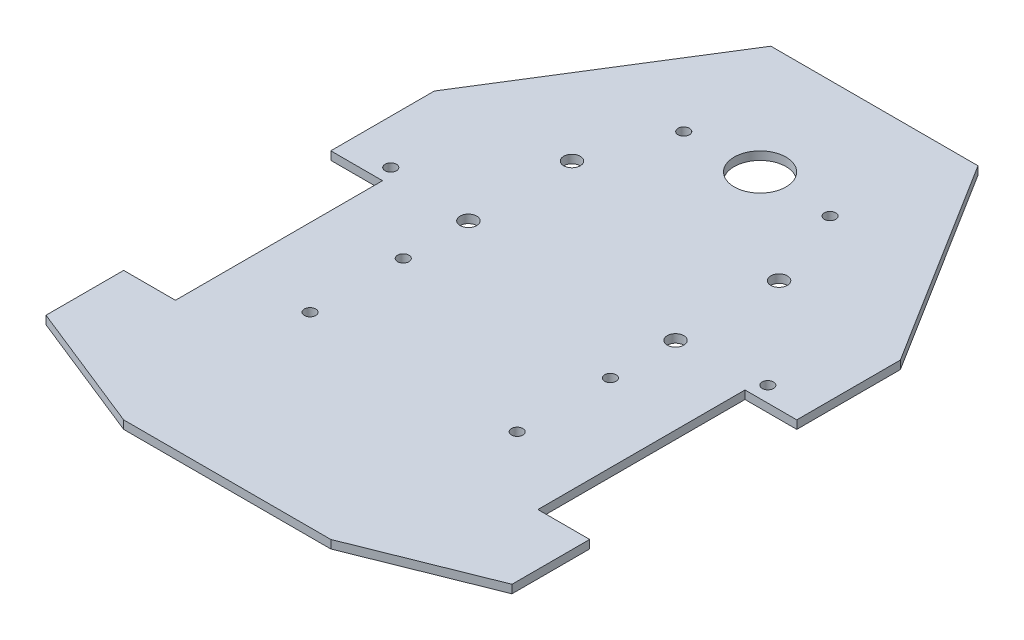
ISO-10303-21;
HEADER;
FILE_DESCRIPTION(('STEP AP214'),'2;1');
FILE_NAME('part.step','',(''),(''),'','','');
FILE_SCHEMA(('AUTOMOTIVE_DESIGN { 1 0 10303 214 1 1 1 1 }'));
ENDSEC;
DATA;
#1=APPLICATION_CONTEXT('core data for automotive mechanical design processes');
#2=APPLICATION_PROTOCOL_DEFINITION('international standard','automotive_design',2000,#1);
#3=PRODUCT_CONTEXT('',#1,'mechanical');
#4=PRODUCT('Part','Part','',(#3));
#5=PRODUCT_RELATED_PRODUCT_CATEGORY('part','',(#4));
#6=PRODUCT_DEFINITION_FORMATION('','',#4);
#7=PRODUCT_DEFINITION_CONTEXT('part definition',#1,'design');
#8=PRODUCT_DEFINITION('design','',#6,#7);
#9=PRODUCT_DEFINITION_SHAPE('','',#8);
#10=(LENGTH_UNIT() NAMED_UNIT(*) SI_UNIT(.MILLI.,.METRE.));
#11=(NAMED_UNIT(*) PLANE_ANGLE_UNIT() SI_UNIT($,.RADIAN.));
#12=(NAMED_UNIT(*) SI_UNIT($,.STERADIAN.) SOLID_ANGLE_UNIT());
#13=UNCERTAINTY_MEASURE_WITH_UNIT(LENGTH_MEASURE(1.E-05),#10,'distance_accuracy_value','');
#14=(GEOMETRIC_REPRESENTATION_CONTEXT(3) GLOBAL_UNCERTAINTY_ASSIGNED_CONTEXT((#13)) GLOBAL_UNIT_ASSIGNED_CONTEXT((#10,
#11,#12)) REPRESENTATION_CONTEXT('',''));
#15=CARTESIAN_POINT('',(0.,0.,0.));
#16=DIRECTION('',(0.,0.,1.));
#17=DIRECTION('',(1.,0.,0.));
#18=AXIS2_PLACEMENT_3D('',#15,#16,#17);
#19=CARTESIAN_POINT('',(0.,1.6,0.));
#20=DIRECTION('',(0.,1.,0.));
#21=DIRECTION('',(0.,0.,1.));
#22=AXIS2_PLACEMENT_3D('',#19,#20,#21);
#23=PLANE('',#22);
#24=CARTESIAN_POINT('',(-36.4122831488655,1.6,-8.00000000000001));
#25=DIRECTION('',(0.,1.,0.));
#26=DIRECTION('',(0.,0.,1.));
#27=AXIS2_PLACEMENT_3D('',#24,#25,#26);
#28=CIRCLE('',#27,1.1);
#29=CARTESIAN_POINT('',(-36.4122831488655,1.6,-6.90000000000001));
#30=VERTEX_POINT('',#29);
#31=EDGE_CURVE('E386',#30,#30,#28,.T.);
#32=ORIENTED_EDGE('',*,*,#31,.F.);
#33=EDGE_LOOP('',(#32));
#34=FACE_BOUND('',#33,.T.);
#35=CARTESIAN_POINT('',(14.1349171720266,1.6,-42.3019535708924));
#36=DIRECTION('',(0.,1.,0.));
#37=DIRECTION('',(0.,0.,-1.));
#38=AXIS2_PLACEMENT_3D('',#35,#36,#37);
#39=CIRCLE('',#38,1.1);
#40=CARTESIAN_POINT('',(14.1349171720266,1.6,-43.4019535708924));
#41=VERTEX_POINT('',#40);
#42=EDGE_CURVE('E401',#41,#41,#39,.T.);
#43=ORIENTED_EDGE('',*,*,#42,.F.);
#44=EDGE_LOOP('',(#43));
#45=FACE_BOUND('',#44,.T.);
#46=CARTESIAN_POINT('',(-14.1349171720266,1.6,-42.3019535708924));
#47=DIRECTION('',(0.,1.,0.));
#48=DIRECTION('',(0.,0.,1.));
#49=AXIS2_PLACEMENT_3D('',#46,#47,#48);
#50=CIRCLE('',#49,1.1);
#51=CARTESIAN_POINT('',(-14.1349171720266,1.6,-41.2019535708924));
#52=VERTEX_POINT('',#51);
#53=EDGE_CURVE('E408',#52,#52,#50,.T.);
#54=ORIENTED_EDGE('',*,*,#53,.F.);
#55=EDGE_LOOP('',(#54));
#56=FACE_BOUND('',#55,.T.);
#57=CARTESIAN_POINT('',(36.4122831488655,1.6,-8.00000000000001));
#58=DIRECTION('',(0.,1.,0.));
#59=DIRECTION('',(0.,0.,-1.));
#60=AXIS2_PLACEMENT_3D('',#57,#58,#59);
#61=CIRCLE('',#60,1.1);
#62=CARTESIAN_POINT('',(36.4122831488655,1.6,-9.1));
#63=VERTEX_POINT('',#62);
#64=EDGE_CURVE('E395',#63,#63,#61,.T.);
#65=ORIENTED_EDGE('',*,*,#64,.F.);
#66=EDGE_LOOP('',(#65));
#67=FACE_BOUND('',#66,.T.);
#68=CARTESIAN_POINT('',(-20.,1.6,-6.58187119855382));
#69=DIRECTION('',(0.,1.,0.));
#70=DIRECTION('',(0.,0.,-1.));
#71=AXIS2_PLACEMENT_3D('',#68,#69,#70);
#72=CIRCLE('',#71,1.6);
#73=CARTESIAN_POINT('',(-20.,1.6,-8.18187119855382));
#74=VERTEX_POINT('',#73);
#75=EDGE_CURVE('E393',#74,#74,#72,.T.);
#76=ORIENTED_EDGE('',*,*,#75,.F.);
#77=EDGE_LOOP('',(#76));
#78=FACE_BOUND('',#77,.T.);
#79=CARTESIAN_POINT('',(20.,1.6,-6.58187119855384));
#80=DIRECTION('',(0.,1.,0.));
#81=DIRECTION('',(0.,0.,1.));
#82=AXIS2_PLACEMENT_3D('',#79,#80,#81);
#83=CIRCLE('',#82,1.6);
#84=CARTESIAN_POINT('',(20.,1.6,-4.98187119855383));
#85=VERTEX_POINT('',#84);
#86=EDGE_CURVE('E419',#85,#85,#83,.T.);
#87=ORIENTED_EDGE('',*,*,#86,.F.);
#88=EDGE_LOOP('',(#87));
#89=FACE_BOUND('',#88,.T.);
#90=CARTESIAN_POINT('',(20.,1.6,-26.5818711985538));
#91=DIRECTION('',(0.,1.,0.));
#92=DIRECTION('',(0.,0.,-1.));
#93=AXIS2_PLACEMENT_3D('',#90,#91,#92);
#94=CIRCLE('',#93,1.6);
#95=CARTESIAN_POINT('',(20.,1.6,-28.1818711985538));
#96=VERTEX_POINT('',#95);
#97=EDGE_CURVE('E418',#96,#96,#94,.T.);
#98=ORIENTED_EDGE('',*,*,#97,.F.);
#99=EDGE_LOOP('',(#98));
#100=FACE_BOUND('',#99,.T.);
#101=CARTESIAN_POINT('',(-20.,1.6,-26.5818711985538));
#102=DIRECTION('',(0.,1.,0.));
#103=DIRECTION('',(0.,0.,1.));
#104=AXIS2_PLACEMENT_3D('',#101,#102,#103);
#105=CIRCLE('',#104,1.6);
#106=CARTESIAN_POINT('',(-20.,1.6,-24.9818711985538));
#107=VERTEX_POINT('',#106);
#108=EDGE_CURVE('E422',#107,#107,#105,.T.);
#109=ORIENTED_EDGE('',*,*,#108,.F.);
#110=EDGE_LOOP('',(#109));
#111=FACE_BOUND('',#110,.T.);
#112=CARTESIAN_POINT('',(20.,1.6,6.00000000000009));
#113=DIRECTION('',(0.,1.,0.));
#114=DIRECTION('',(0.,0.,-1.));
#115=AXIS2_PLACEMENT_3D('',#112,#113,#114);
#116=CIRCLE('',#115,1.1);
#117=CARTESIAN_POINT('',(20.,1.6,4.90000000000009));
#118=VERTEX_POINT('',#117);
#119=EDGE_CURVE('E449',#118,#118,#116,.T.);
#120=ORIENTED_EDGE('',*,*,#119,.F.);
#121=EDGE_LOOP('',(#120));
#122=FACE_BOUND('',#121,.T.);
#123=CARTESIAN_POINT('',(20.,1.6,24.0000000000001));
#124=DIRECTION('',(0.,1.,0.));
#125=DIRECTION('',(0.,0.,1.));
#126=AXIS2_PLACEMENT_3D('',#123,#124,#125);
#127=CIRCLE('',#126,1.1);
#128=CARTESIAN_POINT('',(20.,1.6,25.1000000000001));
#129=VERTEX_POINT('',#128);
#130=EDGE_CURVE('E443',#129,#129,#127,.T.);
#131=ORIENTED_EDGE('',*,*,#130,.F.);
#132=EDGE_LOOP('',(#131));
#133=FACE_BOUND('',#132,.T.);
#134=CARTESIAN_POINT('',(-20.,1.6,24.0000000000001));
#135=DIRECTION('',(0.,1.,0.));
#136=DIRECTION('',(0.,0.,-1.));
#137=AXIS2_PLACEMENT_3D('',#134,#135,#136);
#138=CIRCLE('',#137,1.1);
#139=CARTESIAN_POINT('',(-20.,1.6,22.9000000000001));
#140=VERTEX_POINT('',#139);
#141=EDGE_CURVE('E436',#140,#140,#138,.T.);
#142=ORIENTED_EDGE('',*,*,#141,.F.);
#143=EDGE_LOOP('',(#142));
#144=FACE_BOUND('',#143,.T.);
#145=CARTESIAN_POINT('',(-20.,1.6,6.00000000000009));
#146=DIRECTION('',(0.,1.,0.));
#147=DIRECTION('',(0.,0.,1.));
#148=AXIS2_PLACEMENT_3D('',#145,#146,#147);
#149=CIRCLE('',#148,1.1);
#150=CARTESIAN_POINT('',(-20.,1.6,7.10000000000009));
#151=VERTEX_POINT('',#150);
#152=EDGE_CURVE('E439',#151,#151,#149,.T.);
#153=ORIENTED_EDGE('',*,*,#152,.F.);
#154=EDGE_LOOP('',(#153));
#155=FACE_BOUND('',#154,.T.);
#156=DIRECTION('',(-0.529998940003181,0.,0.847998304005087));
#157=VECTOR('',#156,1.);
#158=CARTESIAN_POINT('',(-45.0000000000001,1.6,-24.9999999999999));
#159=LINE('',#158,#157);
#160=CARTESIAN_POINT('',(-20.,1.6,-64.9999999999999));
#161=VERTEX_POINT('',#160);
#162=CARTESIAN_POINT('',(-45.0000000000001,1.6,-24.9999999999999));
#163=VERTEX_POINT('',#162);
#164=EDGE_CURVE('E224',#161,#163,#159,.T.);
#165=ORIENTED_EDGE('',*,*,#164,.T.);
#166=DIRECTION('',(0.,0.,1.));
#167=VECTOR('',#166,1.);
#168=CARTESIAN_POINT('',(-45.0000000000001,1.6,-24.9999999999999));
#169=LINE('',#168,#167);
#170=CARTESIAN_POINT('',(-45.,1.6,-5.));
#171=VERTEX_POINT('',#170);
#172=EDGE_CURVE('E132',#163,#171,#169,.T.);
#173=ORIENTED_EDGE('',*,*,#172,.T.);
#174=DIRECTION('',(1.,0.,0.));
#175=VECTOR('',#174,1.);
#176=CARTESIAN_POINT('',(-35.,1.6,-5.));
#177=LINE('',#176,#175);
#178=CARTESIAN_POINT('',(-35.,1.6,-5.));
#179=VERTEX_POINT('',#178);
#180=EDGE_CURVE('E263',#171,#179,#177,.T.);
#181=ORIENTED_EDGE('',*,*,#180,.T.);
#182=DIRECTION('',(0.,0.,1.));
#183=VECTOR('',#182,1.);
#184=CARTESIAN_POINT('',(-35.,1.6,35.));
#185=LINE('',#184,#183);
#186=CARTESIAN_POINT('',(-35.,1.6,35.));
#187=VERTEX_POINT('',#186);
#188=EDGE_CURVE('E282',#179,#187,#185,.T.);
#189=ORIENTED_EDGE('',*,*,#188,.T.);
#190=DIRECTION('',(-1.,0.,0.));
#191=VECTOR('',#190,1.);
#192=CARTESIAN_POINT('',(-45.,1.6,35.));
#193=LINE('',#192,#191);
#194=CARTESIAN_POINT('',(-45.,1.6,35.));
#195=VERTEX_POINT('',#194);
#196=EDGE_CURVE('E279',#187,#195,#193,.T.);
#197=ORIENTED_EDGE('',*,*,#196,.T.);
#198=DIRECTION('',(0.,0.,1.));
#199=VECTOR('',#198,1.);
#200=CARTESIAN_POINT('',(-45.,1.6,35.));
#201=LINE('',#200,#199);
#202=CARTESIAN_POINT('',(-45.,1.6,50.));
#203=VERTEX_POINT('',#202);
#204=EDGE_CURVE('E281',#195,#203,#201,.T.);
#205=ORIENTED_EDGE('',*,*,#204,.T.);
#206=DIRECTION('',(0.928476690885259,0.,0.371390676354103));
#207=VECTOR('',#206,1.);
#208=CARTESIAN_POINT('',(-20.,1.6,60.));
#209=LINE('',#208,#207);
#210=CARTESIAN_POINT('',(-20.,1.6,60.));
#211=VERTEX_POINT('',#210);
#212=EDGE_CURVE('E284',#203,#211,#209,.T.);
#213=ORIENTED_EDGE('',*,*,#212,.T.);
#214=DIRECTION('',(1.,0.,0.));
#215=VECTOR('',#214,1.);
#216=CARTESIAN_POINT('',(-20.,1.6,60.));
#217=LINE('',#216,#215);
#218=CARTESIAN_POINT('',(20.,1.6,60.));
#219=VERTEX_POINT('',#218);
#220=EDGE_CURVE('E290',#211,#219,#217,.T.);
#221=ORIENTED_EDGE('',*,*,#220,.T.);
#222=DIRECTION('',(0.928476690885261,0.,-0.3713906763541));
#223=VECTOR('',#222,1.);
#224=CARTESIAN_POINT('',(20.,1.6,60.));
#225=LINE('',#224,#223);
#226=CARTESIAN_POINT('',(45.0000000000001,1.6,50.0000000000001));
#227=VERTEX_POINT('',#226);
#228=EDGE_CURVE('E292',#219,#227,#225,.T.);
#229=ORIENTED_EDGE('',*,*,#228,.T.);
#230=DIRECTION('',(0.,0.,-1.));
#231=VECTOR('',#230,1.);
#232=CARTESIAN_POINT('',(45.0000000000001,1.6,35.0000000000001));
#233=LINE('',#232,#231);
#234=CARTESIAN_POINT('',(45.0000000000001,1.6,35.0000000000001));
#235=VERTEX_POINT('',#234);
#236=EDGE_CURVE('E294',#227,#235,#233,.T.);
#237=ORIENTED_EDGE('',*,*,#236,.T.);
#238=DIRECTION('',(-1.,0.,0.));
#239=VECTOR('',#238,1.);
#240=CARTESIAN_POINT('',(45.0000000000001,1.6,35.0000000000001));
#241=LINE('',#240,#239);
#242=CARTESIAN_POINT('',(35.0000000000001,1.6,35.0000000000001));
#243=VERTEX_POINT('',#242);
#244=EDGE_CURVE('E296',#235,#243,#241,.T.);
#245=ORIENTED_EDGE('',*,*,#244,.T.);
#246=DIRECTION('',(0.,0.,-1.));
#247=VECTOR('',#246,1.);
#248=CARTESIAN_POINT('',(35.0000000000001,1.6,35.0000000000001));
#249=LINE('',#248,#247);
#250=CARTESIAN_POINT('',(35.,1.6,-4.99999999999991));
#251=VERTEX_POINT('',#250);
#252=EDGE_CURVE('E298',#243,#251,#249,.T.);
#253=ORIENTED_EDGE('',*,*,#252,.T.);
#254=DIRECTION('',(1.,0.,0.));
#255=VECTOR('',#254,1.);
#256=CARTESIAN_POINT('',(35.,1.6,-4.99999999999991));
#257=LINE('',#256,#255);
#258=CARTESIAN_POINT('',(45.,1.6,-5.));
#259=VERTEX_POINT('',#258);
#260=EDGE_CURVE('E175',#251,#259,#257,.T.);
#261=ORIENTED_EDGE('',*,*,#260,.T.);
#262=DIRECTION('',(0.,0.,-1.));
#263=VECTOR('',#262,1.);
#264=CARTESIAN_POINT('',(45.0000000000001,1.6,-24.9999999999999));
#265=LINE('',#264,#263);
#266=CARTESIAN_POINT('',(45.0000000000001,1.6,-24.9999999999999));
#267=VERTEX_POINT('',#266);
#268=EDGE_CURVE('E169',#259,#267,#265,.T.);
#269=ORIENTED_EDGE('',*,*,#268,.T.);
#270=DIRECTION('',(-0.529998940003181,0.,-0.847998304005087));
#271=VECTOR('',#270,1.);
#272=CARTESIAN_POINT('',(45.0000000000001,1.6,-24.9999999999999));
#273=LINE('',#272,#271);
#274=CARTESIAN_POINT('',(20.,1.6,-64.9999999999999));
#275=VERTEX_POINT('',#274);
#276=EDGE_CURVE('E173',#267,#275,#273,.T.);
#277=ORIENTED_EDGE('',*,*,#276,.T.);
#278=DIRECTION('',(-1.,0.,0.));
#279=VECTOR('',#278,1.);
#280=CARTESIAN_POINT('',(-20.,1.6,-64.9999999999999));
#281=LINE('',#280,#279);
#282=EDGE_CURVE('E65',#275,#161,#281,.T.);
#283=ORIENTED_EDGE('',*,*,#282,.T.);
#284=EDGE_LOOP('',(#165,#173,#181,#189,#197,#205,#213,#221,#229,#237,#245,#253,#261,#269,#277,#283));
#285=FACE_BOUND('',#284,.T.);
#286=CARTESIAN_POINT('',(0.,1.6,-42.9149479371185));
#287=DIRECTION('',(0.,1.,0.));
#288=DIRECTION('',(0.,0.,1.));
#289=AXIS2_PLACEMENT_3D('',#286,#287,#288);
#290=CIRCLE('',#289,5.);
#291=CARTESIAN_POINT('',(0.,1.6,-37.9149479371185));
#292=VERTEX_POINT('',#291);
#293=EDGE_CURVE('E197',#292,#292,#290,.T.);
#294=ORIENTED_EDGE('',*,*,#293,.F.);
#295=EDGE_LOOP('',(#294));
#296=FACE_BOUND('',#295,.T.);
#297=ADVANCED_FACE('F48',(#34,#45,#56,#67,#78,#89,#100,#111,#122,#133,#144,#155,#285,#296),#23,.T.);
#298=CARTESIAN_POINT('',(0.,0.,0.));
#299=DIRECTION('',(0.,1.,0.));
#300=DIRECTION('',(0.,0.,1.));
#301=AXIS2_PLACEMENT_3D('',#298,#299,#300);
#302=PLANE('',#301);
#303=CARTESIAN_POINT('',(-36.4122831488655,0.,-8.00000000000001));
#304=DIRECTION('',(0.,1.,0.));
#305=DIRECTION('',(0.,0.,1.));
#306=AXIS2_PLACEMENT_3D('',#303,#304,#305);
#307=CIRCLE('',#306,1.1);
#308=CARTESIAN_POINT('',(-36.4122831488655,0.,-6.90000000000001));
#309=VERTEX_POINT('',#308);
#310=EDGE_CURVE('E389',#309,#309,#307,.F.);
#311=ORIENTED_EDGE('',*,*,#310,.F.);
#312=EDGE_LOOP('',(#311));
#313=FACE_BOUND('',#312,.T.);
#314=CARTESIAN_POINT('',(14.1349171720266,0.,-42.3019535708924));
#315=DIRECTION('',(0.,1.,0.));
#316=DIRECTION('',(0.,0.,1.));
#317=AXIS2_PLACEMENT_3D('',#314,#315,#316);
#318=CIRCLE('',#317,1.1);
#319=CARTESIAN_POINT('',(14.1349171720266,0.,-41.2019535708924));
#320=VERTEX_POINT('',#319);
#321=EDGE_CURVE('E398',#320,#320,#318,.F.);
#322=ORIENTED_EDGE('',*,*,#321,.F.);
#323=EDGE_LOOP('',(#322));
#324=FACE_BOUND('',#323,.T.);
#325=CARTESIAN_POINT('',(-14.1349171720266,0.,-42.3019535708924));
#326=DIRECTION('',(0.,1.,0.));
#327=DIRECTION('',(0.,0.,1.));
#328=AXIS2_PLACEMENT_3D('',#325,#326,#327);
#329=CIRCLE('',#328,1.1);
#330=CARTESIAN_POINT('',(-14.1349171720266,0.,-41.2019535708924));
#331=VERTEX_POINT('',#330);
#332=EDGE_CURVE('E404',#331,#331,#329,.F.);
#333=ORIENTED_EDGE('',*,*,#332,.F.);
#334=EDGE_LOOP('',(#333));
#335=FACE_BOUND('',#334,.T.);
#336=CARTESIAN_POINT('',(36.4122831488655,0.,-8.00000000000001));
#337=DIRECTION('',(0.,1.,0.));
#338=DIRECTION('',(0.,0.,1.));
#339=AXIS2_PLACEMENT_3D('',#336,#337,#338);
#340=CIRCLE('',#339,1.1);
#341=CARTESIAN_POINT('',(36.4122831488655,0.,-6.90000000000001));
#342=VERTEX_POINT('',#341);
#343=EDGE_CURVE('E405',#342,#342,#340,.F.);
#344=ORIENTED_EDGE('',*,*,#343,.F.);
#345=EDGE_LOOP('',(#344));
#346=FACE_BOUND('',#345,.T.);
#347=CARTESIAN_POINT('',(-20.,0.,-6.58187119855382));
#348=DIRECTION('',(0.,1.,0.));
#349=DIRECTION('',(0.,0.,1.));
#350=AXIS2_PLACEMENT_3D('',#347,#348,#349);
#351=CIRCLE('',#350,1.6);
#352=CARTESIAN_POINT('',(-20.,0.,-4.98187119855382));
#353=VERTEX_POINT('',#352);
#354=EDGE_CURVE('E390',#353,#353,#351,.F.);
#355=ORIENTED_EDGE('',*,*,#354,.F.);
#356=EDGE_LOOP('',(#355));
#357=FACE_BOUND('',#356,.T.);
#358=CARTESIAN_POINT('',(20.,0.,-6.58187119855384));
#359=DIRECTION('',(0.,1.,0.));
#360=DIRECTION('',(0.,0.,1.));
#361=AXIS2_PLACEMENT_3D('',#358,#359,#360);
#362=CIRCLE('',#361,1.6);
#363=CARTESIAN_POINT('',(20.,0.,-4.98187119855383));
#364=VERTEX_POINT('',#363);
#365=EDGE_CURVE('E423',#364,#364,#362,.F.);
#366=ORIENTED_EDGE('',*,*,#365,.F.);
#367=EDGE_LOOP('',(#366));
#368=FACE_BOUND('',#367,.T.);
#369=CARTESIAN_POINT('',(20.,0.,-26.5818711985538));
#370=DIRECTION('',(0.,1.,0.));
#371=DIRECTION('',(0.,0.,1.));
#372=AXIS2_PLACEMENT_3D('',#369,#370,#371);
#373=CIRCLE('',#372,1.6);
#374=CARTESIAN_POINT('',(20.,0.,-24.9818711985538));
#375=VERTEX_POINT('',#374);
#376=EDGE_CURVE('E415',#375,#375,#373,.F.);
#377=ORIENTED_EDGE('',*,*,#376,.F.);
#378=EDGE_LOOP('',(#377));
#379=FACE_BOUND('',#378,.T.);
#380=CARTESIAN_POINT('',(-20.,0.,-26.5818711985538));
#381=DIRECTION('',(0.,1.,0.));
#382=DIRECTION('',(0.,0.,1.));
#383=AXIS2_PLACEMENT_3D('',#380,#381,#382);
#384=CIRCLE('',#383,1.6);
#385=CARTESIAN_POINT('',(-20.,0.,-24.9818711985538));
#386=VERTEX_POINT('',#385);
#387=EDGE_CURVE('E432',#386,#386,#384,.F.);
#388=ORIENTED_EDGE('',*,*,#387,.F.);
#389=EDGE_LOOP('',(#388));
#390=FACE_BOUND('',#389,.T.);
#391=CARTESIAN_POINT('',(20.,0.,6.00000000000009));
#392=DIRECTION('',(0.,1.,0.));
#393=DIRECTION('',(0.,0.,-1.));
#394=AXIS2_PLACEMENT_3D('',#391,#392,#393);
#395=CIRCLE('',#394,1.1);
#396=CARTESIAN_POINT('',(20.,0.,4.90000000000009));
#397=VERTEX_POINT('',#396);
#398=EDGE_CURVE('E435',#397,#397,#395,.T.);
#399=ORIENTED_EDGE('',*,*,#398,.T.);
#400=EDGE_LOOP('',(#399));
#401=FACE_BOUND('',#400,.T.);
#402=CARTESIAN_POINT('',(20.,0.,24.0000000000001));
#403=DIRECTION('',(0.,1.,0.));
#404=DIRECTION('',(0.,0.,1.));
#405=AXIS2_PLACEMENT_3D('',#402,#403,#404);
#406=CIRCLE('',#405,1.1);
#407=CARTESIAN_POINT('',(20.,0.,25.1000000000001));
#408=VERTEX_POINT('',#407);
#409=EDGE_CURVE('E446',#408,#408,#406,.T.);
#410=ORIENTED_EDGE('',*,*,#409,.T.);
#411=EDGE_LOOP('',(#410));
#412=FACE_BOUND('',#411,.T.);
#413=CARTESIAN_POINT('',(-20.,0.,24.0000000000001));
#414=DIRECTION('',(0.,1.,0.));
#415=DIRECTION('',(0.,0.,-1.));
#416=AXIS2_PLACEMENT_3D('',#413,#414,#415);
#417=CIRCLE('',#416,1.1);
#418=CARTESIAN_POINT('',(-20.,0.,22.9000000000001));
#419=VERTEX_POINT('',#418);
#420=EDGE_CURVE('E440',#419,#419,#417,.T.);
#421=ORIENTED_EDGE('',*,*,#420,.T.);
#422=EDGE_LOOP('',(#421));
#423=FACE_BOUND('',#422,.T.);
#424=CARTESIAN_POINT('',(-20.,0.,6.00000000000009));
#425=DIRECTION('',(0.,1.,0.));
#426=DIRECTION('',(0.,0.,1.));
#427=AXIS2_PLACEMENT_3D('',#424,#425,#426);
#428=CIRCLE('',#427,1.1);
#429=CARTESIAN_POINT('',(-20.,0.,7.10000000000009));
#430=VERTEX_POINT('',#429);
#431=EDGE_CURVE('E454',#430,#430,#428,.T.);
#432=ORIENTED_EDGE('',*,*,#431,.T.);
#433=EDGE_LOOP('',(#432));
#434=FACE_BOUND('',#433,.T.);
#435=DIRECTION('',(-0.529998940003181,0.,0.847998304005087));
#436=VECTOR('',#435,1.);
#437=CARTESIAN_POINT('',(-45.0000000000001,0.,-24.9999999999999));
#438=LINE('',#437,#436);
#439=CARTESIAN_POINT('',(-20.,0.,-64.9999999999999));
#440=VERTEX_POINT('',#439);
#441=CARTESIAN_POINT('',(-45.0000000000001,0.,-24.9999999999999));
#442=VERTEX_POINT('',#441);
#443=EDGE_CURVE('E193',#440,#442,#438,.T.);
#444=ORIENTED_EDGE('',*,*,#443,.F.);
#445=DIRECTION('',(-1.,0.,0.));
#446=VECTOR('',#445,1.);
#447=CARTESIAN_POINT('',(-20.,0.,-64.9999999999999));
#448=LINE('',#447,#446);
#449=CARTESIAN_POINT('',(20.,0.,-64.9999999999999));
#450=VERTEX_POINT('',#449);
#451=EDGE_CURVE('E124',#450,#440,#448,.T.);
#452=ORIENTED_EDGE('',*,*,#451,.F.);
#453=DIRECTION('',(-0.529998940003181,0.,-0.847998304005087));
#454=VECTOR('',#453,1.);
#455=CARTESIAN_POINT('',(45.0000000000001,0.,-24.9999999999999));
#456=LINE('',#455,#454);
#457=CARTESIAN_POINT('',(45.0000000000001,0.,-24.9999999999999));
#458=VERTEX_POINT('',#457);
#459=EDGE_CURVE('E118',#458,#450,#456,.T.);
#460=ORIENTED_EDGE('',*,*,#459,.F.);
#461=DIRECTION('',(0.,0.,-1.));
#462=VECTOR('',#461,1.);
#463=CARTESIAN_POINT('',(45.0000000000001,0.,-24.9999999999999));
#464=LINE('',#463,#462);
#465=CARTESIAN_POINT('',(45.,0.,-5.));
#466=VERTEX_POINT('',#465);
#467=EDGE_CURVE('E183',#466,#458,#464,.T.);
#468=ORIENTED_EDGE('',*,*,#467,.F.);
#469=DIRECTION('',(1.,0.,0.));
#470=VECTOR('',#469,1.);
#471=CARTESIAN_POINT('',(35.,0.,-4.99999999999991));
#472=LINE('',#471,#470);
#473=CARTESIAN_POINT('',(35.,0.,-4.99999999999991));
#474=VERTEX_POINT('',#473);
#475=EDGE_CURVE('E219',#474,#466,#472,.T.);
#476=ORIENTED_EDGE('',*,*,#475,.F.);
#477=DIRECTION('',(0.,0.,-1.));
#478=VECTOR('',#477,1.);
#479=CARTESIAN_POINT('',(35.0000000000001,0.,35.0000000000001));
#480=LINE('',#479,#478);
#481=CARTESIAN_POINT('',(35.0000000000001,0.,35.0000000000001));
#482=VERTEX_POINT('',#481);
#483=EDGE_CURVE('E217',#482,#474,#480,.T.);
#484=ORIENTED_EDGE('',*,*,#483,.F.);
#485=DIRECTION('',(-1.,0.,0.));
#486=VECTOR('',#485,1.);
#487=CARTESIAN_POINT('',(45.0000000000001,0.,35.0000000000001));
#488=LINE('',#487,#486);
#489=CARTESIAN_POINT('',(45.0000000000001,0.,35.0000000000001));
#490=VERTEX_POINT('',#489);
#491=EDGE_CURVE('E215',#490,#482,#488,.T.);
#492=ORIENTED_EDGE('',*,*,#491,.F.);
#493=DIRECTION('',(0.,0.,-1.));
#494=VECTOR('',#493,1.);
#495=CARTESIAN_POINT('',(45.0000000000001,0.,35.0000000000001));
#496=LINE('',#495,#494);
#497=CARTESIAN_POINT('',(45.0000000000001,0.,50.0000000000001));
#498=VERTEX_POINT('',#497);
#499=EDGE_CURVE('E213',#498,#490,#496,.T.);
#500=ORIENTED_EDGE('',*,*,#499,.F.);
#501=DIRECTION('',(0.928476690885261,0.,-0.3713906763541));
#502=VECTOR('',#501,1.);
#503=CARTESIAN_POINT('',(20.,0.,60.));
#504=LINE('',#503,#502);
#505=CARTESIAN_POINT('',(20.,0.,60.));
#506=VERTEX_POINT('',#505);
#507=EDGE_CURVE('E211',#506,#498,#504,.T.);
#508=ORIENTED_EDGE('',*,*,#507,.F.);
#509=DIRECTION('',(1.,0.,0.));
#510=VECTOR('',#509,1.);
#511=CARTESIAN_POINT('',(-20.,0.,60.));
#512=LINE('',#511,#510);
#513=CARTESIAN_POINT('',(-20.,0.,60.));
#514=VERTEX_POINT('',#513);
#515=EDGE_CURVE('E209',#514,#506,#512,.T.);
#516=ORIENTED_EDGE('',*,*,#515,.F.);
#517=DIRECTION('',(0.928476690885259,0.,0.371390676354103));
#518=VECTOR('',#517,1.);
#519=CARTESIAN_POINT('',(-20.,0.,60.));
#520=LINE('',#519,#518);
#521=CARTESIAN_POINT('',(-45.,0.,50.));
#522=VERTEX_POINT('',#521);
#523=EDGE_CURVE('E207',#522,#514,#520,.T.);
#524=ORIENTED_EDGE('',*,*,#523,.F.);
#525=DIRECTION('',(0.,0.,1.));
#526=VECTOR('',#525,1.);
#527=CARTESIAN_POINT('',(-45.,0.,35.));
#528=LINE('',#527,#526);
#529=CARTESIAN_POINT('',(-45.,0.,35.));
#530=VERTEX_POINT('',#529);
#531=EDGE_CURVE('E205',#530,#522,#528,.T.);
#532=ORIENTED_EDGE('',*,*,#531,.F.);
#533=DIRECTION('',(-1.,0.,0.));
#534=VECTOR('',#533,1.);
#535=CARTESIAN_POINT('',(-45.,0.,35.));
#536=LINE('',#535,#534);
#537=CARTESIAN_POINT('',(-35.,0.,35.));
#538=VERTEX_POINT('',#537);
#539=EDGE_CURVE('E203',#538,#530,#536,.T.);
#540=ORIENTED_EDGE('',*,*,#539,.F.);
#541=DIRECTION('',(0.,0.,1.));
#542=VECTOR('',#541,1.);
#543=CARTESIAN_POINT('',(-35.,0.,35.));
#544=LINE('',#543,#542);
#545=CARTESIAN_POINT('',(-35.,0.,-5.));
#546=VERTEX_POINT('',#545);
#547=EDGE_CURVE('E201',#546,#538,#544,.T.);
#548=ORIENTED_EDGE('',*,*,#547,.F.);
#549=DIRECTION('',(1.,0.,0.));
#550=VECTOR('',#549,1.);
#551=CARTESIAN_POINT('',(-35.,0.,-5.));
#552=LINE('',#551,#550);
#553=CARTESIAN_POINT('',(-45.,0.,-5.));
#554=VERTEX_POINT('',#553);
#555=EDGE_CURVE('E199',#554,#546,#552,.T.);
#556=ORIENTED_EDGE('',*,*,#555,.F.);
#557=DIRECTION('',(0.,0.,1.));
#558=VECTOR('',#557,1.);
#559=CARTESIAN_POINT('',(-45.0000000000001,0.,-24.9999999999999));
#560=LINE('',#559,#558);
#561=EDGE_CURVE('E196',#442,#554,#560,.T.);
#562=ORIENTED_EDGE('',*,*,#561,.F.);
#563=EDGE_LOOP('',(#444,#452,#460,#468,#476,#484,#492,#500,#508,#516,#524,#532,#540,#548,#556,#562));
#564=FACE_BOUND('',#563,.T.);
#565=CARTESIAN_POINT('',(0.,0.,-42.9149479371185));
#566=DIRECTION('',(0.,1.,0.));
#567=DIRECTION('',(0.,0.,1.));
#568=AXIS2_PLACEMENT_3D('',#565,#566,#567);
#569=CIRCLE('',#568,5.);
#570=CARTESIAN_POINT('',(0.,0.,-37.9149479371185));
#571=VERTEX_POINT('',#570);
#572=EDGE_CURVE('E457',#571,#571,#569,.T.);
#573=ORIENTED_EDGE('',*,*,#572,.T.);
#574=EDGE_LOOP('',(#573));
#575=FACE_BOUND('',#574,.T.);
#576=ADVANCED_FACE('F267',(#313,#324,#335,#346,#357,#368,#379,#390,#401,#412,#423,#434,#564,
#575),#302,.F.);
#577=CARTESIAN_POINT('',(-45.0000000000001,1.6,-24.9999999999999));
#578=DIRECTION('',(0.847998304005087,0.,0.529998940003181));
#579=DIRECTION('',(0.529998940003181,0.,-0.847998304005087));
#580=AXIS2_PLACEMENT_3D('',#577,#578,#579);
#581=PLANE('',#580);
#582=ORIENTED_EDGE('',*,*,#443,.T.);
#583=DIRECTION('',(0.,-1.,0.));
#584=VECTOR('',#583,1.);
#585=CARTESIAN_POINT('',(-45.0000000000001,1.6,-24.9999999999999));
#586=LINE('',#585,#584);
#587=EDGE_CURVE('E13',#163,#442,#586,.T.);
#588=ORIENTED_EDGE('',*,*,#587,.F.);
#589=ORIENTED_EDGE('',*,*,#164,.F.);
#590=DIRECTION('',(0.,-1.,0.));
#591=VECTOR('',#590,1.);
#592=CARTESIAN_POINT('',(-20.,1.6,-64.9999999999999));
#593=LINE('',#592,#591);
#594=EDGE_CURVE('E189',#161,#440,#593,.T.);
#595=ORIENTED_EDGE('',*,*,#594,.T.);
#596=EDGE_LOOP('',(#582,#588,#589,#595));
#597=FACE_BOUND('',#596,.T.);
#598=ADVANCED_FACE('F50',(#597),#581,.F.);
#599=CARTESIAN_POINT('',(-45.0000000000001,1.6,-24.9999999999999));
#600=DIRECTION('',(1.,0.,0.));
#601=DIRECTION('',(0.,0.,-1.));
#602=AXIS2_PLACEMENT_3D('',#599,#600,#601);
#603=PLANE('',#602);
#604=ORIENTED_EDGE('',*,*,#561,.T.);
#605=DIRECTION('',(0.,-1.,0.));
#606=VECTOR('',#605,1.);
#607=CARTESIAN_POINT('',(-45.,1.6,-5.));
#608=LINE('',#607,#606);
#609=EDGE_CURVE('E57',#171,#554,#608,.T.);
#610=ORIENTED_EDGE('',*,*,#609,.F.);
#611=ORIENTED_EDGE('',*,*,#172,.F.);
#612=ORIENTED_EDGE('',*,*,#587,.T.);
#613=EDGE_LOOP('',(#604,#610,#611,#612));
#614=FACE_BOUND('',#613,.T.);
#615=ADVANCED_FACE('F702',(#614),#603,.F.);
#616=CARTESIAN_POINT('',(-35.,1.6,-5.));
#617=DIRECTION('',(0.,0.,-1.));
#618=DIRECTION('',(-1.,0.,0.));
#619=AXIS2_PLACEMENT_3D('',#616,#617,#618);
#620=PLANE('',#619);
#621=ORIENTED_EDGE('',*,*,#555,.T.);
#622=DIRECTION('',(0.,-1.,0.));
#623=VECTOR('',#622,1.);
#624=CARTESIAN_POINT('',(-35.,1.6,-5.));
#625=LINE('',#624,#623);
#626=EDGE_CURVE('E255',#179,#546,#625,.T.);
#627=ORIENTED_EDGE('',*,*,#626,.F.);
#628=ORIENTED_EDGE('',*,*,#180,.F.);
#629=ORIENTED_EDGE('',*,*,#609,.T.);
#630=EDGE_LOOP('',(#621,#627,#628,#629));
#631=FACE_BOUND('',#630,.T.);
#632=ADVANCED_FACE('F261',(#631),#620,.F.);
#633=CARTESIAN_POINT('',(-35.,1.6,35.));
#634=DIRECTION('',(1.,0.,0.));
#635=DIRECTION('',(0.,0.,-1.));
#636=AXIS2_PLACEMENT_3D('',#633,#634,#635);
#637=PLANE('',#636);
#638=ORIENTED_EDGE('',*,*,#547,.T.);
#639=DIRECTION('',(0.,-1.,0.));
#640=VECTOR('',#639,1.);
#641=CARTESIAN_POINT('',(-35.,1.6,35.));
#642=LINE('',#641,#640);
#643=EDGE_CURVE('E252',#187,#538,#642,.T.);
#644=ORIENTED_EDGE('',*,*,#643,.F.);
#645=ORIENTED_EDGE('',*,*,#188,.F.);
#646=ORIENTED_EDGE('',*,*,#626,.T.);
#647=EDGE_LOOP('',(#638,#644,#645,#646));
#648=FACE_BOUND('',#647,.T.);
#649=ADVANCED_FACE('F273',(#648),#637,.F.);
#650=CARTESIAN_POINT('',(-45.,1.6,35.));
#651=DIRECTION('',(0.,0.,1.));
#652=DIRECTION('',(1.,0.,0.));
#653=AXIS2_PLACEMENT_3D('',#650,#651,#652);
#654=PLANE('',#653);
#655=ORIENTED_EDGE('',*,*,#539,.T.);
#656=DIRECTION('',(0.,-1.,0.));
#657=VECTOR('',#656,1.);
#658=CARTESIAN_POINT('',(-45.,1.6,35.));
#659=LINE('',#658,#657);
#660=EDGE_CURVE('E249',#195,#530,#659,.T.);
#661=ORIENTED_EDGE('',*,*,#660,.F.);
#662=ORIENTED_EDGE('',*,*,#196,.F.);
#663=ORIENTED_EDGE('',*,*,#643,.T.);
#664=EDGE_LOOP('',(#655,#661,#662,#663));
#665=FACE_BOUND('',#664,.T.);
#666=ADVANCED_FACE('F277',(#665),#654,.F.);
#667=CARTESIAN_POINT('',(-45.,1.6,35.));
#668=DIRECTION('',(1.,0.,0.));
#669=DIRECTION('',(0.,0.,-1.));
#670=AXIS2_PLACEMENT_3D('',#667,#668,#669);
#671=PLANE('',#670);
#672=ORIENTED_EDGE('',*,*,#531,.T.);
#673=DIRECTION('',(0.,-1.,0.));
#674=VECTOR('',#673,1.);
#675=CARTESIAN_POINT('',(-45.,1.6,50.));
#676=LINE('',#675,#674);
#677=EDGE_CURVE('E246',#203,#522,#676,.T.);
#678=ORIENTED_EDGE('',*,*,#677,.F.);
#679=ORIENTED_EDGE('',*,*,#204,.F.);
#680=ORIENTED_EDGE('',*,*,#660,.T.);
#681=EDGE_LOOP('',(#672,#678,#679,#680));
#682=FACE_BOUND('',#681,.T.);
#683=ADVANCED_FACE('F663',(#682),#671,.F.);
#684=CARTESIAN_POINT('',(-20.,1.6,60.));
#685=DIRECTION('',(0.371390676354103,0.,-0.928476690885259));
#686=DIRECTION('',(-0.92847669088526,0.,-0.371390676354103));
#687=AXIS2_PLACEMENT_3D('',#684,#685,#686);
#688=PLANE('',#687);
#689=ORIENTED_EDGE('',*,*,#523,.T.);
#690=DIRECTION('',(0.,-1.,0.));
#691=VECTOR('',#690,1.);
#692=CARTESIAN_POINT('',(-20.,1.6,60.));
#693=LINE('',#692,#691);
#694=EDGE_CURVE('E243',#211,#514,#693,.T.);
#695=ORIENTED_EDGE('',*,*,#694,.F.);
#696=ORIENTED_EDGE('',*,*,#212,.F.);
#697=ORIENTED_EDGE('',*,*,#677,.T.);
#698=EDGE_LOOP('',(#689,#695,#696,#697));
#699=FACE_BOUND('',#698,.T.);
#700=ADVANCED_FACE('F652',(#699),#688,.F.);
#701=CARTESIAN_POINT('',(-20.,1.6,60.));
#702=DIRECTION('',(0.,0.,-1.));
#703=DIRECTION('',(-1.,0.,0.));
#704=AXIS2_PLACEMENT_3D('',#701,#702,#703);
#705=PLANE('',#704);
#706=ORIENTED_EDGE('',*,*,#515,.T.);
#707=DIRECTION('',(0.,-1.,0.));
#708=VECTOR('',#707,1.);
#709=CARTESIAN_POINT('',(20.,1.6,60.));
#710=LINE('',#709,#708);
#711=EDGE_CURVE('E240',#219,#506,#710,.T.);
#712=ORIENTED_EDGE('',*,*,#711,.F.);
#713=ORIENTED_EDGE('',*,*,#220,.F.);
#714=ORIENTED_EDGE('',*,*,#694,.T.);
#715=EDGE_LOOP('',(#706,#712,#713,#714));
#716=FACE_BOUND('',#715,.T.);
#717=ADVANCED_FACE('F641',(#716),#705,.F.);
#718=CARTESIAN_POINT('',(20.,1.6,60.));
#719=DIRECTION('',(-0.3713906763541,0.,-0.928476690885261));
#720=DIRECTION('',(-0.928476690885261,0.,0.3713906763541));
#721=AXIS2_PLACEMENT_3D('',#718,#719,#720);
#722=PLANE('',#721);
#723=ORIENTED_EDGE('',*,*,#507,.T.);
#724=DIRECTION('',(0.,-1.,0.));
#725=VECTOR('',#724,1.);
#726=CARTESIAN_POINT('',(45.0000000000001,1.6,50.0000000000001));
#727=LINE('',#726,#725);
#728=EDGE_CURVE('E237',#227,#498,#727,.T.);
#729=ORIENTED_EDGE('',*,*,#728,.F.);
#730=ORIENTED_EDGE('',*,*,#228,.F.);
#731=ORIENTED_EDGE('',*,*,#711,.T.);
#732=EDGE_LOOP('',(#723,#729,#730,#731));
#733=FACE_BOUND('',#732,.T.);
#734=ADVANCED_FACE('F630',(#733),#722,.F.);
#735=CARTESIAN_POINT('',(45.0000000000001,1.6,35.0000000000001));
#736=DIRECTION('',(-1.,0.,0.));
#737=DIRECTION('',(0.,0.,1.));
#738=AXIS2_PLACEMENT_3D('',#735,#736,#737);
#739=PLANE('',#738);
#740=ORIENTED_EDGE('',*,*,#499,.T.);
#741=DIRECTION('',(0.,-1.,0.));
#742=VECTOR('',#741,1.);
#743=CARTESIAN_POINT('',(45.0000000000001,1.6,35.0000000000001));
#744=LINE('',#743,#742);
#745=EDGE_CURVE('E234',#235,#490,#744,.T.);
#746=ORIENTED_EDGE('',*,*,#745,.F.);
#747=ORIENTED_EDGE('',*,*,#236,.F.);
#748=ORIENTED_EDGE('',*,*,#728,.T.);
#749=EDGE_LOOP('',(#740,#746,#747,#748));
#750=FACE_BOUND('',#749,.T.);
#751=ADVANCED_FACE('F619',(#750),#739,.F.);
#752=CARTESIAN_POINT('',(45.0000000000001,1.6,35.0000000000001));
#753=DIRECTION('',(0.,0.,1.));
#754=DIRECTION('',(1.,0.,0.));
#755=AXIS2_PLACEMENT_3D('',#752,#753,#754);
#756=PLANE('',#755);
#757=ORIENTED_EDGE('',*,*,#491,.T.);
#758=DIRECTION('',(0.,-1.,0.));
#759=VECTOR('',#758,1.);
#760=CARTESIAN_POINT('',(35.0000000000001,1.6,35.0000000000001));
#761=LINE('',#760,#759);
#762=EDGE_CURVE('E231',#243,#482,#761,.T.);
#763=ORIENTED_EDGE('',*,*,#762,.F.);
#764=ORIENTED_EDGE('',*,*,#244,.F.);
#765=ORIENTED_EDGE('',*,*,#745,.T.);
#766=EDGE_LOOP('',(#757,#763,#764,#765));
#767=FACE_BOUND('',#766,.T.);
#768=ADVANCED_FACE('F609',(#767),#756,.F.);
#769=CARTESIAN_POINT('',(35.0000000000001,1.6,35.0000000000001));
#770=DIRECTION('',(-1.,0.,0.));
#771=DIRECTION('',(0.,0.,1.));
#772=AXIS2_PLACEMENT_3D('',#769,#770,#771);
#773=PLANE('',#772);
#774=ORIENTED_EDGE('',*,*,#483,.T.);
#775=DIRECTION('',(0.,-1.,0.));
#776=VECTOR('',#775,1.);
#777=CARTESIAN_POINT('',(35.,1.6,-4.99999999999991));
#778=LINE('',#777,#776);
#779=EDGE_CURVE('E228',#251,#474,#778,.T.);
#780=ORIENTED_EDGE('',*,*,#779,.F.);
#781=ORIENTED_EDGE('',*,*,#252,.F.);
#782=ORIENTED_EDGE('',*,*,#762,.T.);
#783=EDGE_LOOP('',(#774,#780,#781,#782));
#784=FACE_BOUND('',#783,.T.);
#785=ADVANCED_FACE('F304',(#784),#773,.F.);
#786=CARTESIAN_POINT('',(35.,1.6,-4.99999999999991));
#787=DIRECTION('',(0.,0.,-1.));
#788=DIRECTION('',(-1.,0.,0.));
#789=AXIS2_PLACEMENT_3D('',#786,#787,#788);
#790=PLANE('',#789);
#791=ORIENTED_EDGE('',*,*,#475,.T.);
#792=DIRECTION('',(0.,-1.,0.));
#793=VECTOR('',#792,1.);
#794=CARTESIAN_POINT('',(45.,1.6,-5.));
#795=LINE('',#794,#793);
#796=EDGE_CURVE('E184',#259,#466,#795,.T.);
#797=ORIENTED_EDGE('',*,*,#796,.F.);
#798=ORIENTED_EDGE('',*,*,#260,.F.);
#799=ORIENTED_EDGE('',*,*,#779,.T.);
#800=EDGE_LOOP('',(#791,#797,#798,#799));
#801=FACE_BOUND('',#800,.T.);
#802=ADVANCED_FACE('F308',(#801),#790,.F.);
#803=CARTESIAN_POINT('',(45.0000000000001,1.6,-24.9999999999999));
#804=DIRECTION('',(-1.,0.,0.));
#805=DIRECTION('',(0.,0.,1.));
#806=AXIS2_PLACEMENT_3D('',#803,#804,#805);
#807=PLANE('',#806);
#808=ORIENTED_EDGE('',*,*,#467,.T.);
#809=DIRECTION('',(0.,-1.,0.));
#810=VECTOR('',#809,1.);
#811=CARTESIAN_POINT('',(45.0000000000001,1.6,-24.9999999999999));
#812=LINE('',#811,#810);
#813=EDGE_CURVE('E180',#267,#458,#812,.T.);
#814=ORIENTED_EDGE('',*,*,#813,.F.);
#815=ORIENTED_EDGE('',*,*,#268,.F.);
#816=ORIENTED_EDGE('',*,*,#796,.T.);
#817=EDGE_LOOP('',(#808,#814,#815,#816));
#818=FACE_BOUND('',#817,.T.);
#819=ADVANCED_FACE('F181',(#818),#807,.F.);
#820=CARTESIAN_POINT('',(45.0000000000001,1.6,-24.9999999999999));
#821=DIRECTION('',(-0.847998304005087,0.,0.529998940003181));
#822=DIRECTION('',(0.529998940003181,0.,0.847998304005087));
#823=AXIS2_PLACEMENT_3D('',#820,#821,#822);
#824=PLANE('',#823);
#825=ORIENTED_EDGE('',*,*,#459,.T.);
#826=DIRECTION('',(0.,-1.,0.));
#827=VECTOR('',#826,1.);
#828=CARTESIAN_POINT('',(20.,1.6,-64.9999999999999));
#829=LINE('',#828,#827);
#830=EDGE_CURVE('E185',#275,#450,#829,.T.);
#831=ORIENTED_EDGE('',*,*,#830,.F.);
#832=ORIENTED_EDGE('',*,*,#276,.F.);
#833=ORIENTED_EDGE('',*,*,#813,.T.);
#834=EDGE_LOOP('',(#825,#831,#832,#833));
#835=FACE_BOUND('',#834,.T.);
#836=ADVANCED_FACE('F187',(#835),#824,.F.);
#837=CARTESIAN_POINT('',(-20.,1.6,-64.9999999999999));
#838=DIRECTION('',(0.,0.,1.));
#839=DIRECTION('',(1.,0.,0.));
#840=AXIS2_PLACEMENT_3D('',#837,#838,#839);
#841=PLANE('',#840);
#842=ORIENTED_EDGE('',*,*,#451,.T.);
#843=ORIENTED_EDGE('',*,*,#594,.F.);
#844=ORIENTED_EDGE('',*,*,#282,.F.);
#845=ORIENTED_EDGE('',*,*,#830,.T.);
#846=EDGE_LOOP('',(#842,#843,#844,#845));
#847=FACE_BOUND('',#846,.T.);
#848=ADVANCED_FACE('F312',(#847),#841,.F.);
#849=CARTESIAN_POINT('',(0.,1.6,-42.9149479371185));
#850=DIRECTION('',(0.,-1.,0.));
#851=DIRECTION('',(0.,0.,-1.));
#852=AXIS2_PLACEMENT_3D('',#849,#850,#851);
#853=CYLINDRICAL_SURFACE('',#852,5.);
#854=ORIENTED_EDGE('',*,*,#293,.T.);
#855=EDGE_LOOP('',(#854));
#856=FACE_BOUND('',#855,.T.);
#857=ORIENTED_EDGE('',*,*,#572,.F.);
#858=EDGE_LOOP('',(#857));
#859=FACE_BOUND('',#858,.T.);
#860=ADVANCED_FACE('F314',(#856,#859),#853,.F.);
#861=CARTESIAN_POINT('',(-20.,0.,6.00000000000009));
#862=DIRECTION('',(0.,1.,0.));
#863=DIRECTION('',(0.,0.,1.));
#864=AXIS2_PLACEMENT_3D('',#861,#862,#863);
#865=CYLINDRICAL_SURFACE('',#864,1.1);
#866=ORIENTED_EDGE('',*,*,#431,.F.);
#867=EDGE_LOOP('',(#866));
#868=FACE_BOUND('',#867,.T.);
#869=ORIENTED_EDGE('',*,*,#152,.T.);
#870=EDGE_LOOP('',(#869));
#871=FACE_BOUND('',#870,.T.);
#872=ADVANCED_FACE('F320',(#868,#871),#865,.F.);
#873=CARTESIAN_POINT('',(-20.,0.,24.0000000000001));
#874=DIRECTION('',(0.,1.,0.));
#875=DIRECTION('',(0.,0.,1.));
#876=AXIS2_PLACEMENT_3D('',#873,#874,#875);
#877=CYLINDRICAL_SURFACE('',#876,1.1);
#878=ORIENTED_EDGE('',*,*,#420,.F.);
#879=EDGE_LOOP('',(#878));
#880=FACE_BOUND('',#879,.T.);
#881=ORIENTED_EDGE('',*,*,#141,.T.);
#882=EDGE_LOOP('',(#881));
#883=FACE_BOUND('',#882,.T.);
#884=ADVANCED_FACE('F338',(#880,#883),#877,.F.);
#885=CARTESIAN_POINT('',(20.,0.,24.0000000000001));
#886=DIRECTION('',(0.,1.,0.));
#887=DIRECTION('',(0.,0.,1.));
#888=AXIS2_PLACEMENT_3D('',#885,#886,#887);
#889=CYLINDRICAL_SURFACE('',#888,1.1);
#890=ORIENTED_EDGE('',*,*,#409,.F.);
#891=EDGE_LOOP('',(#890));
#892=FACE_BOUND('',#891,.T.);
#893=ORIENTED_EDGE('',*,*,#130,.T.);
#894=EDGE_LOOP('',(#893));
#895=FACE_BOUND('',#894,.T.);
#896=ADVANCED_FACE('F344',(#892,#895),#889,.F.);
#897=CARTESIAN_POINT('',(20.,0.,6.00000000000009));
#898=DIRECTION('',(0.,1.,0.));
#899=DIRECTION('',(0.,0.,1.));
#900=AXIS2_PLACEMENT_3D('',#897,#898,#899);
#901=CYLINDRICAL_SURFACE('',#900,1.1);
#902=ORIENTED_EDGE('',*,*,#398,.F.);
#903=EDGE_LOOP('',(#902));
#904=FACE_BOUND('',#903,.T.);
#905=ORIENTED_EDGE('',*,*,#119,.T.);
#906=EDGE_LOOP('',(#905));
#907=FACE_BOUND('',#906,.T.);
#908=ADVANCED_FACE('F340',(#904,#907),#901,.F.);
#909=CARTESIAN_POINT('',(-20.,-0.000999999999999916,-26.5818711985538));
#910=DIRECTION('',(0.,1.,0.));
#911=DIRECTION('',(0.,0.,1.));
#912=AXIS2_PLACEMENT_3D('',#909,#910,#911);
#913=CYLINDRICAL_SURFACE('',#912,1.6);
#914=ORIENTED_EDGE('',*,*,#108,.T.);
#915=EDGE_LOOP('',(#914));
#916=FACE_BOUND('',#915,.T.);
#917=ORIENTED_EDGE('',*,*,#387,.T.);
#918=EDGE_LOOP('',(#917));
#919=FACE_BOUND('',#918,.T.);
#920=ADVANCED_FACE('F343',(#916,#919),#913,.F.);
#921=CARTESIAN_POINT('',(20.,-0.000999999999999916,-26.5818711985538));
#922=DIRECTION('',(0.,1.,0.));
#923=DIRECTION('',(0.,0.,1.));
#924=AXIS2_PLACEMENT_3D('',#921,#922,#923);
#925=CYLINDRICAL_SURFACE('',#924,1.6);
#926=ORIENTED_EDGE('',*,*,#97,.T.);
#927=EDGE_LOOP('',(#926));
#928=FACE_BOUND('',#927,.T.);
#929=ORIENTED_EDGE('',*,*,#376,.T.);
#930=EDGE_LOOP('',(#929));
#931=FACE_BOUND('',#930,.T.);
#932=ADVANCED_FACE('F354',(#928,#931),#925,.F.);
#933=CARTESIAN_POINT('',(20.,-0.000999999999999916,-6.58187119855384));
#934=DIRECTION('',(0.,1.,0.));
#935=DIRECTION('',(0.,0.,1.));
#936=AXIS2_PLACEMENT_3D('',#933,#934,#935);
#937=CYLINDRICAL_SURFACE('',#936,1.6);
#938=ORIENTED_EDGE('',*,*,#86,.T.);
#939=EDGE_LOOP('',(#938));
#940=FACE_BOUND('',#939,.T.);
#941=ORIENTED_EDGE('',*,*,#365,.T.);
#942=EDGE_LOOP('',(#941));
#943=FACE_BOUND('',#942,.T.);
#944=ADVANCED_FACE('F360',(#940,#943),#937,.F.);
#945=CARTESIAN_POINT('',(-20.,-0.000999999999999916,-6.58187119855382));
#946=DIRECTION('',(0.,1.,0.));
#947=DIRECTION('',(0.,0.,1.));
#948=AXIS2_PLACEMENT_3D('',#945,#946,#947);
#949=CYLINDRICAL_SURFACE('',#948,1.6);
#950=ORIENTED_EDGE('',*,*,#75,.T.);
#951=EDGE_LOOP('',(#950));
#952=FACE_BOUND('',#951,.T.);
#953=ORIENTED_EDGE('',*,*,#354,.T.);
#954=EDGE_LOOP('',(#953));
#955=FACE_BOUND('',#954,.T.);
#956=ADVANCED_FACE('F356',(#952,#955),#949,.F.);
#957=CARTESIAN_POINT('',(36.4122831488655,-0.000999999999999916,-8.00000000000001));
#958=DIRECTION('',(0.,1.,0.));
#959=DIRECTION('',(0.,0.,1.));
#960=AXIS2_PLACEMENT_3D('',#957,#958,#959);
#961=CYLINDRICAL_SURFACE('',#960,1.1);
#962=ORIENTED_EDGE('',*,*,#64,.T.);
#963=EDGE_LOOP('',(#962));
#964=FACE_BOUND('',#963,.T.);
#965=ORIENTED_EDGE('',*,*,#343,.T.);
#966=EDGE_LOOP('',(#965));
#967=FACE_BOUND('',#966,.T.);
#968=ADVANCED_FACE('F359',(#964,#967),#961,.F.);
#969=CARTESIAN_POINT('',(-14.1349171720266,-0.000999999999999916,-42.3019535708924));
#970=DIRECTION('',(0.,1.,0.));
#971=DIRECTION('',(0.,0.,1.));
#972=AXIS2_PLACEMENT_3D('',#969,#970,#971);
#973=CYLINDRICAL_SURFACE('',#972,1.1);
#974=ORIENTED_EDGE('',*,*,#53,.T.);
#975=EDGE_LOOP('',(#974));
#976=FACE_BOUND('',#975,.T.);
#977=ORIENTED_EDGE('',*,*,#332,.T.);
#978=EDGE_LOOP('',(#977));
#979=FACE_BOUND('',#978,.T.);
#980=ADVANCED_FACE('F368',(#976,#979),#973,.F.);
#981=CARTESIAN_POINT('',(14.1349171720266,-0.000999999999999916,-42.3019535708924));
#982=DIRECTION('',(0.,1.,0.));
#983=DIRECTION('',(0.,0.,1.));
#984=AXIS2_PLACEMENT_3D('',#981,#982,#983);
#985=CYLINDRICAL_SURFACE('',#984,1.1);
#986=ORIENTED_EDGE('',*,*,#42,.T.);
#987=EDGE_LOOP('',(#986));
#988=FACE_BOUND('',#987,.T.);
#989=ORIENTED_EDGE('',*,*,#321,.T.);
#990=EDGE_LOOP('',(#989));
#991=FACE_BOUND('',#990,.T.);
#992=ADVANCED_FACE('F371',(#988,#991),#985,.F.);
#993=CARTESIAN_POINT('',(-36.4122831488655,-0.000999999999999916,-8.00000000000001));
#994=DIRECTION('',(0.,1.,0.));
#995=DIRECTION('',(0.,0.,1.));
#996=AXIS2_PLACEMENT_3D('',#993,#994,#995);
#997=CYLINDRICAL_SURFACE('',#996,1.1);
#998=ORIENTED_EDGE('',*,*,#31,.T.);
#999=EDGE_LOOP('',(#998));
#1000=FACE_BOUND('',#999,.T.);
#1001=ORIENTED_EDGE('',*,*,#310,.T.);
#1002=EDGE_LOOP('',(#1001));
#1003=FACE_BOUND('',#1002,.T.);
#1004=ADVANCED_FACE('F378',(#1000,#1003),#997,.F.);
#1005=CLOSED_SHELL('',(#297,#576,#598,#615,#632,#649,#666,#683,#700,#717,#734,#751,#768,#785,
#802,#819,#836,#848,#860,#872,#884,#896,#908,#920,#932,#944,#956,#968,#980,#992,#1004));
#1006=MANIFOLD_SOLID_BREP('B2',#1005);
#1007=ADVANCED_BREP_SHAPE_REPRESENTATION('',(#18,#1006),#14);
#1008=SHAPE_DEFINITION_REPRESENTATION(#9,#1007);
ENDSEC;
END-ISO-10303-21;
